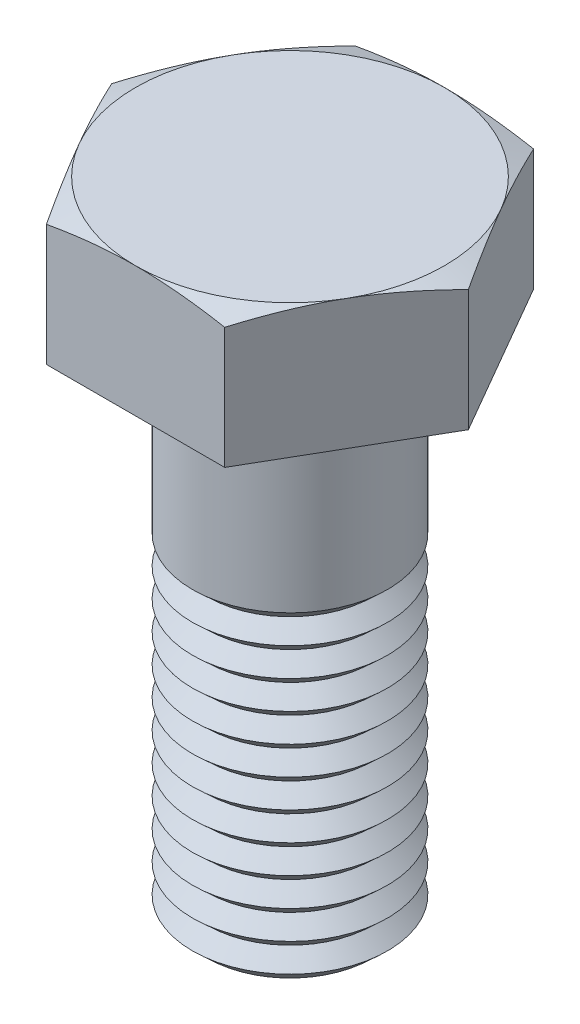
from build123d import *

# Parameters (mm, degrees)
EXTRUDE_1_DEPTH = 8


with BuildPart() as part:
    # Sketch 2 → Extrude 1 (new body)
    with BuildSketch(Plane(origin=(0, 0, 0), x_dir=(1, 0, 0), z_dir=(0, 1, 0))):
        Polygon((10.969655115, 0), (5.484827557, 9.5), (-5.484827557, 9.5), (-10.969655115, 0), (-5.484827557, -9.5), (5.484827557, -9.5), align=None)
    extrude(amount=-EXTRUDE_1_DEPTH)

    # Sketch 3 → Cut-Revolve 1 (revolve, cut)
    with BuildSketch(Plane.XY):
        Polygon((-11.547596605, 0), (-9.5, 0), (-11.547596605, -0.745264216), align=None)
    revolve(axis=Axis((0, 1.716062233, 0), (0, -1, 0)), mode=Mode.SUBTRACT)

    # Sketch 4 → Revolve 1 (revolve)
    with BuildSketch(Plane.XY, mode=Mode.PRIVATE) as revolve_1_sk:
        Polygon((0, -8), (0, -38), (5.053, -39.125), (6, -38.25), (5.053, -37.375), (6, -36.5), (5.053, -35.625), (6, -34.75), (5.053, -33.875), (6, -33), (5.053, -32.125), (6, -31.25), (5.053, -30.375), (6, -29.5), (5.053, -28.625), (6, -27.75), (5.053, -26.875), (6, -26), (5.053, -25.125), (6, -24.25), (5.053, -23.375), (6, -22.5), (5.053, -21.625), (6, -20.75), (5.053, -19.875), (6, -19), (6, -8), align=None)
    revolve(revolve_1_sk.sketch.rotate(Axis((0, 0.847372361, 0), (0, -1, 0)), 90), axis=Axis((0, 0.847372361, 0), (0, -1, 0)))


solid = part.part
